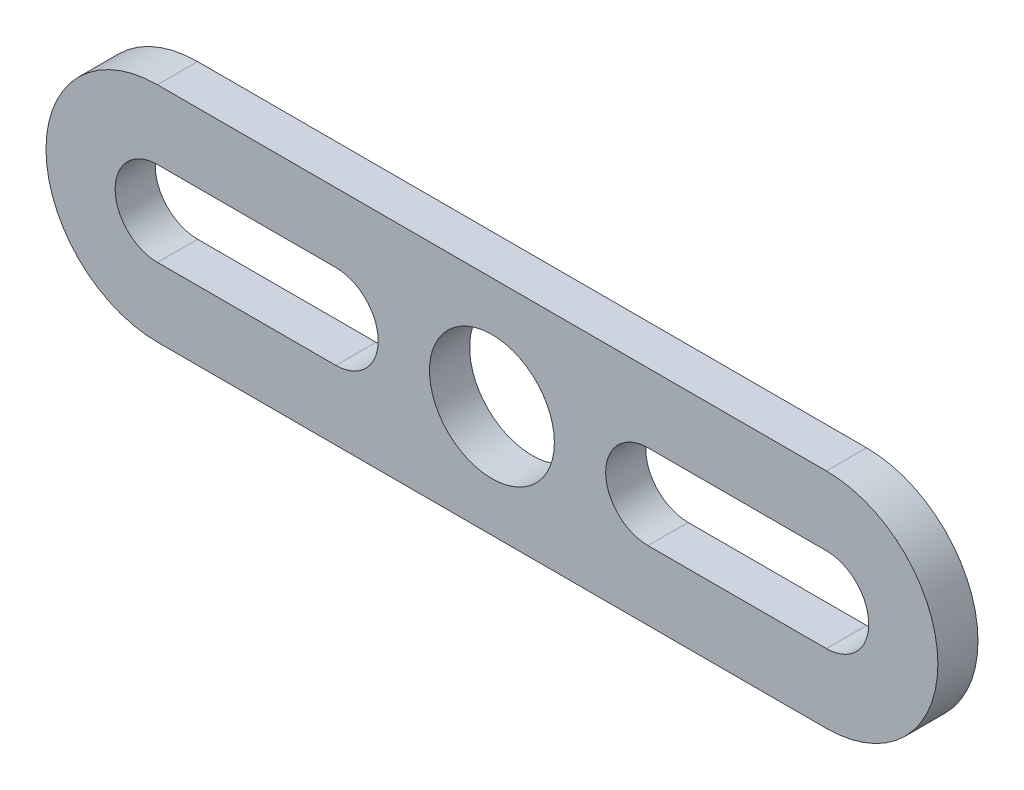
from build123d import *

# Parameters (mm, degrees)
EXTRUDE1_DEPTH    = 2.286
SLOT_CUT_DEPTH    = 27.281329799
SKETCH3_R         = 3.556
HOLE_CENTER_DEPTH = 27.281329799


with BuildPart() as part:
    # Sketch1 → Extrude1 (new body)
    with BuildSketch(Plane.XY):
        with BuildLine():
            Line((-19.05, -6.35), (19.05, -6.35))
            ThreePointArc((19.05, -6.35), (25.4, 0), (19.05, 6.35))
            Line((19.05, 6.35), (-19.05, 6.35))
            ThreePointArc((-19.05, 6.35), (-25.4, 0), (-19.05, -6.35))
        make_face()
    extrude(amount=EXTRUDE1_DEPTH)

    # Sketch2 → Slot Cut (cut, through all)
    with BuildSketch(Plane.XY.offset(2.286)):
        with BuildLine():
            Line((8.89, 2.413), (19.05, 2.413))
            ThreePointArc((19.05, 2.413), (21.463, 0), (19.05, -2.413))
            Line((19.05, -2.413), (8.89, -2.413))
            ThreePointArc((8.89, -2.413), (6.477, 0), (8.89, 2.413))
        make_face()
    slot_cut = extrude(amount=-SLOT_CUT_DEPTH, mode=Mode.SUBTRACT)

    # Mirror1: Slot Cut across plane
    add(slot_cut.mirror(Plane(origin=(0, 0, 0), x_dir=(0, 0, 1), z_dir=(1, 0, 0))), mode=Mode.SUBTRACT)

    # Sketch3 → Hole-Center (cut, through all)
    with BuildSketch(Plane.XY.offset(2.286)):
        Circle(SKETCH3_R)
    extrude(amount=-HOLE_CENTER_DEPTH, mode=Mode.SUBTRACT)


solid = part.part
